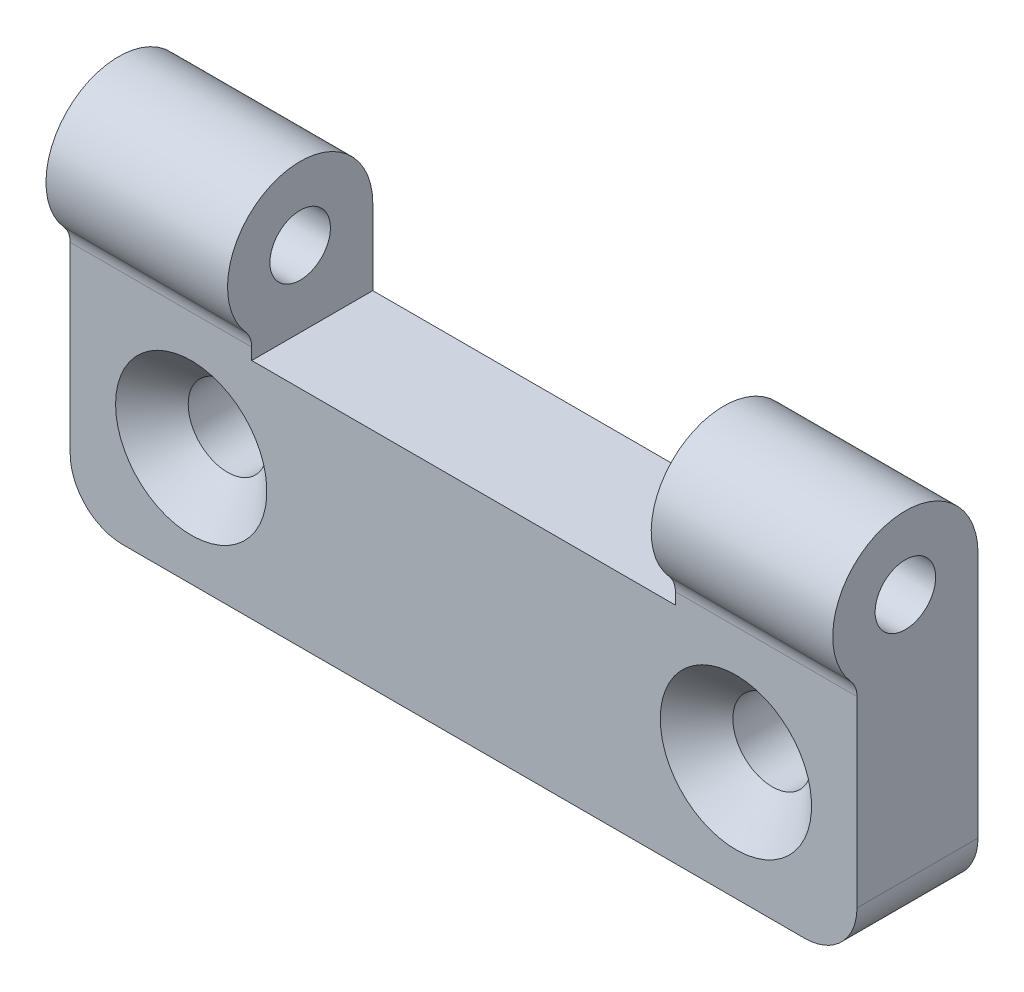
ISO-10303-21;
HEADER;
FILE_DESCRIPTION(('STEP AP214'),'2;1');
FILE_NAME('part.step','',(''),(''),'','','');
FILE_SCHEMA(('AUTOMOTIVE_DESIGN { 1 0 10303 214 1 1 1 1 }'));
ENDSEC;
DATA;
#1=APPLICATION_CONTEXT('core data for automotive mechanical design processes');
#2=APPLICATION_PROTOCOL_DEFINITION('international standard','automotive_design',2000,#1);
#3=PRODUCT_CONTEXT('',#1,'mechanical');
#4=PRODUCT('Part','Part','',(#3));
#5=PRODUCT_RELATED_PRODUCT_CATEGORY('part','',(#4));
#6=PRODUCT_DEFINITION_FORMATION('','',#4);
#7=PRODUCT_DEFINITION_CONTEXT('part definition',#1,'design');
#8=PRODUCT_DEFINITION('design','',#6,#7);
#9=PRODUCT_DEFINITION_SHAPE('','',#8);
#10=(LENGTH_UNIT() NAMED_UNIT(*) SI_UNIT(.MILLI.,.METRE.));
#11=(NAMED_UNIT(*) PLANE_ANGLE_UNIT() SI_UNIT($,.RADIAN.));
#12=(NAMED_UNIT(*) SI_UNIT($,.STERADIAN.) SOLID_ANGLE_UNIT());
#13=UNCERTAINTY_MEASURE_WITH_UNIT(LENGTH_MEASURE(1.E-05),#10,'distance_accuracy_value','');
#14=(GEOMETRIC_REPRESENTATION_CONTEXT(3) GLOBAL_UNCERTAINTY_ASSIGNED_CONTEXT((#13)) GLOBAL_UNIT_ASSIGNED_CONTEXT((#10,
#11,#12)) REPRESENTATION_CONTEXT('',''));
#15=CARTESIAN_POINT('',(0.,0.,0.));
#16=DIRECTION('',(0.,0.,1.));
#17=DIRECTION('',(1.,0.,0.));
#18=AXIS2_PLACEMENT_3D('',#15,#16,#17);
#19=CARTESIAN_POINT('',(-10.,9.70849737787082,12.));
#20=DIRECTION('',(-1.,0.,0.));
#21=DIRECTION('',(0.,-1.,0.));
#22=AXIS2_PLACEMENT_3D('',#19,#20,#21);
#23=CYLINDRICAL_SURFACE('',#22,2.);
#24=DIRECTION('',(-1.,0.,0.));
#25=VECTOR('',#24,1.);
#26=CARTESIAN_POINT('',(-10.,11.0313730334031,10.5));
#27=LINE('',#26,#25);
#28=CARTESIAN_POINT('',(-10.,11.0313730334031,10.5));
#29=VERTEX_POINT('',#28);
#30=CARTESIAN_POINT('',(5.,11.0313730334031,10.5));
#31=VERTEX_POINT('',#30);
#32=EDGE_CURVE('E91',#29,#31,#27,.F.);
#33=ORIENTED_EDGE('',*,*,#32,.F.);
#34=CARTESIAN_POINT('',(-10.,9.70849737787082,12.));
#35=DIRECTION('',(-1.,0.,0.));
#36=DIRECTION('',(0.,-1.,0.));
#37=AXIS2_PLACEMENT_3D('',#34,#35,#36);
#38=CIRCLE('',#37,2.);
#39=CARTESIAN_POINT('',(-10.,9.70849737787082,10.));
#40=VERTEX_POINT('',#39);
#41=EDGE_CURVE('E17',#40,#29,#38,.F.);
#42=ORIENTED_EDGE('',*,*,#41,.F.);
#43=DIRECTION('',(-1.,0.,0.));
#44=VECTOR('',#43,1.);
#45=CARTESIAN_POINT('',(22.5,9.70849737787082,10.));
#46=LINE('',#45,#44);
#47=CARTESIAN_POINT('',(5.,9.70849737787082,10.));
#48=VERTEX_POINT('',#47);
#49=EDGE_CURVE('E119',#48,#40,#46,.T.);
#50=ORIENTED_EDGE('',*,*,#49,.F.);
#51=CARTESIAN_POINT('',(5.,9.70849737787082,12.));
#52=DIRECTION('',(-1.,0.,0.));
#53=DIRECTION('',(0.,-1.,0.));
#54=AXIS2_PLACEMENT_3D('',#51,#52,#53);
#55=CIRCLE('',#54,2.);
#56=EDGE_CURVE('E105',#31,#48,#55,.T.);
#57=ORIENTED_EDGE('',*,*,#56,.F.);
#58=EDGE_LOOP('',(#33,#42,#50,#57));
#59=FACE_BOUND('',#58,.T.);
#60=ADVANCED_FACE('F14',(#59),#23,.F.);
#61=CARTESIAN_POINT('',(-10.,9.70849737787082,12.));
#62=DIRECTION('',(-1.,0.,0.));
#63=DIRECTION('',(0.,-1.,0.));
#64=AXIS2_PLACEMENT_3D('',#61,#62,#63);
#65=CYLINDRICAL_SURFACE('',#64,2.);
#66=DIRECTION('',(-1.,0.,0.));
#67=VECTOR('',#66,1.);
#68=CARTESIAN_POINT('',(22.5,9.70849737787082,10.));
#69=LINE('',#68,#67);
#70=CARTESIAN_POINT('',(55.,9.70849737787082,10.));
#71=VERTEX_POINT('',#70);
#72=CARTESIAN_POINT('',(40.,9.70849737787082,10.));
#73=VERTEX_POINT('',#72);
#74=EDGE_CURVE('E121',#71,#73,#69,.T.);
#75=ORIENTED_EDGE('',*,*,#74,.F.);
#76=CARTESIAN_POINT('',(55.,9.70849737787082,12.));
#77=DIRECTION('',(-1.,0.,0.));
#78=DIRECTION('',(0.,-1.,0.));
#79=AXIS2_PLACEMENT_3D('',#76,#77,#78);
#80=CIRCLE('',#79,2.);
#81=CARTESIAN_POINT('',(55.,11.0313730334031,10.5));
#82=VERTEX_POINT('',#81);
#83=EDGE_CURVE('E113',#82,#71,#80,.T.);
#84=ORIENTED_EDGE('',*,*,#83,.F.);
#85=DIRECTION('',(-1.,0.,0.));
#86=VECTOR('',#85,1.);
#87=CARTESIAN_POINT('',(-10.,11.0313730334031,10.5));
#88=LINE('',#87,#86);
#89=CARTESIAN_POINT('',(40.,11.0313730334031,10.5));
#90=VERTEX_POINT('',#89);
#91=EDGE_CURVE('E134',#90,#82,#88,.F.);
#92=ORIENTED_EDGE('',*,*,#91,.F.);
#93=CARTESIAN_POINT('',(40.,9.70849737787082,12.));
#94=DIRECTION('',(-1.,0.,0.));
#95=DIRECTION('',(0.,-1.,0.));
#96=AXIS2_PLACEMENT_3D('',#93,#94,#95);
#97=CIRCLE('',#96,2.);
#98=EDGE_CURVE('E108',#73,#90,#97,.F.);
#99=ORIENTED_EDGE('',*,*,#98,.F.);
#100=EDGE_LOOP('',(#75,#84,#92,#99));
#101=FACE_BOUND('',#100,.T.);
#102=ADVANCED_FACE('F310',(#101),#65,.F.);
#103=CARTESIAN_POINT('',(45.,0.,10.0000000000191));
#104=DIRECTION('',(0.,0.,1.));
#105=DIRECTION('',(-1.,0.,0.));
#106=AXIS2_PLACEMENT_3D('',#103,#104,#105);
#107=CONICAL_SURFACE('',#106,6.2500000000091,0.785398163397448);
#108=CARTESIAN_POINT('',(45.,0.,10.0000000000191));
#109=DIRECTION('',(0.,0.,1.));
#110=DIRECTION('',(-1.,0.,0.));
#111=AXIS2_PLACEMENT_3D('',#108,#109,#110);
#112=CIRCLE('',#111,6.2500000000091);
#113=CARTESIAN_POINT('',(38.7499999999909,0.,10.0000000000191));
#114=VERTEX_POINT('',#113);
#115=EDGE_CURVE('E107',#114,#114,#112,.F.);
#116=ORIENTED_EDGE('',*,*,#115,.F.);
#117=EDGE_LOOP('',(#116));
#118=FACE_BOUND('',#117,.T.);
#119=CARTESIAN_POINT('',(45.,0.,7.));
#120=DIRECTION('',(0.,0.,-1.));
#121=DIRECTION('',(1.,0.,0.));
#122=AXIS2_PLACEMENT_3D('',#119,#120,#121);
#123=CIRCLE('',#122,3.25);
#124=CARTESIAN_POINT('',(48.25,0.,7.));
#125=VERTEX_POINT('',#124);
#126=EDGE_CURVE('E131',#125,#125,#123,.T.);
#127=ORIENTED_EDGE('',*,*,#126,.T.);
#128=EDGE_LOOP('',(#127));
#129=FACE_BOUND('',#128,.T.);
#130=ADVANCED_FACE('F312',(#118,#129),#107,.F.);
#131=CARTESIAN_POINT('',(0.,0.,10.0000000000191));
#132=DIRECTION('',(0.,0.,1.));
#133=DIRECTION('',(-1.,0.,0.));
#134=AXIS2_PLACEMENT_3D('',#131,#132,#133);
#135=CONICAL_SURFACE('',#134,6.2500000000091,0.785398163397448);
#136=CARTESIAN_POINT('',(0.,0.,10.0000000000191));
#137=DIRECTION('',(0.,0.,1.));
#138=DIRECTION('',(-1.,0.,0.));
#139=AXIS2_PLACEMENT_3D('',#136,#137,#138);
#140=CIRCLE('',#139,6.2500000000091);
#141=CARTESIAN_POINT('',(-6.2500000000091,0.,10.0000000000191));
#142=VERTEX_POINT('',#141);
#143=EDGE_CURVE('E111',#142,#142,#140,.F.);
#144=ORIENTED_EDGE('',*,*,#143,.F.);
#145=EDGE_LOOP('',(#144));
#146=FACE_BOUND('',#145,.T.);
#147=CARTESIAN_POINT('',(0.,0.,7.));
#148=DIRECTION('',(0.,0.,-1.));
#149=DIRECTION('',(1.,0.,0.));
#150=AXIS2_PLACEMENT_3D('',#147,#148,#149);
#151=CIRCLE('',#150,3.25);
#152=CARTESIAN_POINT('',(3.25,0.,7.));
#153=VERTEX_POINT('',#152);
#154=EDGE_CURVE('E127',#153,#153,#151,.T.);
#155=ORIENTED_EDGE('',*,*,#154,.T.);
#156=EDGE_LOOP('',(#155));
#157=FACE_BOUND('',#156,.T.);
#158=ADVANCED_FACE('F318',(#146,#157),#135,.F.);
#159=CARTESIAN_POINT('',(-10.,15.,6.));
#160=DIRECTION('',(-1.,0.,0.));
#161=DIRECTION('',(0.,-1.,0.));
#162=AXIS2_PLACEMENT_3D('',#159,#160,#161);
#163=CYLINDRICAL_SURFACE('',#162,2.5);
#164=CARTESIAN_POINT('',(5.,15.,6.));
#165=DIRECTION('',(-1.,0.,0.));
#166=DIRECTION('',(0.,-1.,0.));
#167=AXIS2_PLACEMENT_3D('',#164,#165,#166);
#168=CIRCLE('',#167,2.5);
#169=CARTESIAN_POINT('',(5.,12.5,6.));
#170=VERTEX_POINT('',#169);
#171=EDGE_CURVE('E175',#170,#170,#168,.F.);
#172=ORIENTED_EDGE('',*,*,#171,.T.);
#173=EDGE_LOOP('',(#172));
#174=FACE_BOUND('',#173,.T.);
#175=CARTESIAN_POINT('',(-10.,15.,6.));
#176=DIRECTION('',(-1.,0.,0.));
#177=DIRECTION('',(0.,-1.,0.));
#178=AXIS2_PLACEMENT_3D('',#175,#176,#177);
#179=CIRCLE('',#178,2.5);
#180=CARTESIAN_POINT('',(-10.,12.5,6.));
#181=VERTEX_POINT('',#180);
#182=EDGE_CURVE('E169',#181,#181,#179,.F.);
#183=ORIENTED_EDGE('',*,*,#182,.F.);
#184=EDGE_LOOP('',(#183));
#185=FACE_BOUND('',#184,.T.);
#186=ADVANCED_FACE('F324',(#174,#185),#163,.F.);
#187=CARTESIAN_POINT('',(22.5,15.,10.));
#188=DIRECTION('',(0.,0.,1.));
#189=DIRECTION('',(-1.,0.,0.));
#190=AXIS2_PLACEMENT_3D('',#187,#188,#189);
#191=PLANE('',#190);
#192=DIRECTION('',(0.,1.,0.));
#193=VECTOR('',#192,1.);
#194=CARTESIAN_POINT('',(55.,6.58333333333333,10.));
#195=LINE('',#194,#193);
#196=CARTESIAN_POINT('',(55.,-5.4166666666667,10.));
#197=VERTEX_POINT('',#196);
#198=EDGE_CURVE('E162',#71,#197,#195,.F.);
#199=ORIENTED_EDGE('',*,*,#198,.F.);
#200=ORIENTED_EDGE('',*,*,#74,.T.);
#201=DIRECTION('',(0.,-1.,0.));
#202=VECTOR('',#201,1.);
#203=CARTESIAN_POINT('',(40.,15.,10.));
#204=LINE('',#203,#202);
#205=CARTESIAN_POINT('',(40.,8.75,10.));
#206=VERTEX_POINT('',#205);
#207=EDGE_CURVE('E122',#73,#206,#204,.T.);
#208=ORIENTED_EDGE('',*,*,#207,.T.);
#209=DIRECTION('',(1.,0.,0.));
#210=VECTOR('',#209,1.);
#211=CARTESIAN_POINT('',(40.,8.75,10.));
#212=LINE('',#211,#210);
#213=CARTESIAN_POINT('',(5.,8.75,10.));
#214=VERTEX_POINT('',#213);
#215=EDGE_CURVE('E130',#206,#214,#212,.F.);
#216=ORIENTED_EDGE('',*,*,#215,.T.);
#217=DIRECTION('',(0.,-1.,0.));
#218=VECTOR('',#217,1.);
#219=CARTESIAN_POINT('',(5.,8.75,10.));
#220=LINE('',#219,#218);
#221=EDGE_CURVE('E174',#214,#48,#220,.F.);
#222=ORIENTED_EDGE('',*,*,#221,.T.);
#223=ORIENTED_EDGE('',*,*,#49,.T.);
#224=DIRECTION('',(0.,-1.,0.));
#225=VECTOR('',#224,1.);
#226=CARTESIAN_POINT('',(-10.,-5.4166666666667,10.));
#227=LINE('',#226,#225);
#228=CARTESIAN_POINT('',(-10.,-5.4166666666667,10.));
#229=VERTEX_POINT('',#228);
#230=EDGE_CURVE('E98',#229,#40,#227,.F.);
#231=ORIENTED_EDGE('',*,*,#230,.F.);
#232=CARTESIAN_POINT('',(-5.6666666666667,-5.4166666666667,10.));
#233=DIRECTION('',(0.,0.,-1.));
#234=DIRECTION('',(1.,0.,0.));
#235=AXIS2_PLACEMENT_3D('',#232,#233,#234);
#236=CIRCLE('',#235,4.33333333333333);
#237=CARTESIAN_POINT('',(-5.6666666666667,-9.75,10.));
#238=VERTEX_POINT('',#237);
#239=EDGE_CURVE('E97',#238,#229,#236,.T.);
#240=ORIENTED_EDGE('',*,*,#239,.F.);
#241=DIRECTION('',(1.,0.,0.));
#242=VECTOR('',#241,1.);
#243=CARTESIAN_POINT('',(50.6666666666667,-9.75,10.));
#244=LINE('',#243,#242);
#245=CARTESIAN_POINT('',(50.6666666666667,-9.75,10.));
#246=VERTEX_POINT('',#245);
#247=EDGE_CURVE('E117',#246,#238,#244,.F.);
#248=ORIENTED_EDGE('',*,*,#247,.F.);
#249=CARTESIAN_POINT('',(50.6666666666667,-5.4166666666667,10.));
#250=DIRECTION('',(0.,0.,-1.));
#251=DIRECTION('',(1.,0.,0.));
#252=AXIS2_PLACEMENT_3D('',#249,#250,#251);
#253=CIRCLE('',#252,4.33333333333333);
#254=EDGE_CURVE('E164',#197,#246,#253,.T.);
#255=ORIENTED_EDGE('',*,*,#254,.F.);
#256=EDGE_LOOP('',(#199,#200,#208,#216,#222,#223,#231,#240,#248,#255));
#257=FACE_BOUND('',#256,.T.);
#258=ORIENTED_EDGE('',*,*,#143,.T.);
#259=EDGE_LOOP('',(#258));
#260=FACE_BOUND('',#259,.T.);
#261=ORIENTED_EDGE('',*,*,#115,.T.);
#262=EDGE_LOOP('',(#261));
#263=FACE_BOUND('',#262,.T.);
#264=ADVANCED_FACE('F192',(#257,#260,#263),#191,.T.);
#265=CARTESIAN_POINT('',(-10.,15.,6.));
#266=DIRECTION('',(-1.,0.,0.));
#267=DIRECTION('',(0.,-1.,0.));
#268=AXIS2_PLACEMENT_3D('',#265,#266,#267);
#269=CYLINDRICAL_SURFACE('',#268,2.5);
#270=CARTESIAN_POINT('',(55.,15.,6.));
#271=DIRECTION('',(-1.,0.,0.));
#272=DIRECTION('',(0.,-1.,0.));
#273=AXIS2_PLACEMENT_3D('',#270,#271,#272);
#274=CIRCLE('',#273,2.5);
#275=CARTESIAN_POINT('',(55.,12.5,6.));
#276=VERTEX_POINT('',#275);
#277=EDGE_CURVE('E159',#276,#276,#274,.T.);
#278=ORIENTED_EDGE('',*,*,#277,.F.);
#279=EDGE_LOOP('',(#278));
#280=FACE_BOUND('',#279,.T.);
#281=CARTESIAN_POINT('',(40.,15.,6.));
#282=DIRECTION('',(-1.,0.,0.));
#283=DIRECTION('',(0.,-1.,0.));
#284=AXIS2_PLACEMENT_3D('',#281,#282,#283);
#285=CIRCLE('',#284,2.5);
#286=CARTESIAN_POINT('',(40.,12.5,6.));
#287=VERTEX_POINT('',#286);
#288=EDGE_CURVE('E153',#287,#287,#285,.T.);
#289=ORIENTED_EDGE('',*,*,#288,.T.);
#290=EDGE_LOOP('',(#289));
#291=FACE_BOUND('',#290,.T.);
#292=ADVANCED_FACE('F331',(#280,#291),#269,.F.);
#293=CARTESIAN_POINT('',(45.,0.,3.5));
#294=DIRECTION('',(0.,0.,-1.));
#295=DIRECTION('',(1.,0.,0.));
#296=AXIS2_PLACEMENT_3D('',#293,#294,#295);
#297=CYLINDRICAL_SURFACE('',#296,3.25);
#298=ORIENTED_EDGE('',*,*,#126,.F.);
#299=EDGE_LOOP('',(#298));
#300=FACE_BOUND('',#299,.T.);
#301=CARTESIAN_POINT('',(45.,0.,0.));
#302=DIRECTION('',(0.,0.,-1.));
#303=DIRECTION('',(1.,0.,0.));
#304=AXIS2_PLACEMENT_3D('',#301,#302,#303);
#305=CIRCLE('',#304,3.25);
#306=CARTESIAN_POINT('',(48.25,0.,0.));
#307=VERTEX_POINT('',#306);
#308=EDGE_CURVE('E148',#307,#307,#305,.T.);
#309=ORIENTED_EDGE('',*,*,#308,.T.);
#310=EDGE_LOOP('',(#309));
#311=FACE_BOUND('',#310,.T.);
#312=ADVANCED_FACE('F334',(#300,#311),#297,.F.);
#313=CARTESIAN_POINT('',(0.,0.,3.5));
#314=DIRECTION('',(0.,0.,-1.));
#315=DIRECTION('',(1.,0.,0.));
#316=AXIS2_PLACEMENT_3D('',#313,#314,#315);
#317=CYLINDRICAL_SURFACE('',#316,3.25);
#318=ORIENTED_EDGE('',*,*,#154,.F.);
#319=EDGE_LOOP('',(#318));
#320=FACE_BOUND('',#319,.T.);
#321=CARTESIAN_POINT('',(0.,0.,0.));
#322=DIRECTION('',(0.,0.,-1.));
#323=DIRECTION('',(1.,0.,0.));
#324=AXIS2_PLACEMENT_3D('',#321,#322,#323);
#325=CIRCLE('',#324,3.25);
#326=CARTESIAN_POINT('',(3.25,0.,0.));
#327=VERTEX_POINT('',#326);
#328=EDGE_CURVE('E144',#327,#327,#325,.T.);
#329=ORIENTED_EDGE('',*,*,#328,.T.);
#330=EDGE_LOOP('',(#329));
#331=FACE_BOUND('',#330,.T.);
#332=ADVANCED_FACE('F338',(#320,#331),#317,.F.);
#333=CARTESIAN_POINT('',(40.,8.75,0.));
#334=DIRECTION('',(0.,-1.,0.));
#335=DIRECTION('',(1.,0.,0.));
#336=AXIS2_PLACEMENT_3D('',#333,#334,#335);
#337=PLANE('',#336);
#338=DIRECTION('',(0.,0.,1.));
#339=VECTOR('',#338,1.);
#340=CARTESIAN_POINT('',(40.,8.75,0.));
#341=LINE('',#340,#339);
#342=CARTESIAN_POINT('',(40.,8.75,0.));
#343=VERTEX_POINT('',#342);
#344=EDGE_CURVE('E152',#206,#343,#341,.F.);
#345=ORIENTED_EDGE('',*,*,#344,.T.);
#346=DIRECTION('',(-1.,0.,0.));
#347=VECTOR('',#346,1.);
#348=CARTESIAN_POINT('',(22.5,8.75,0.));
#349=LINE('',#348,#347);
#350=CARTESIAN_POINT('',(5.,8.75,0.));
#351=VERTEX_POINT('',#350);
#352=EDGE_CURVE('E147',#343,#351,#349,.T.);
#353=ORIENTED_EDGE('',*,*,#352,.T.);
#354=DIRECTION('',(0.,0.,1.));
#355=VECTOR('',#354,1.);
#356=CARTESIAN_POINT('',(5.,8.75,0.));
#357=LINE('',#356,#355);
#358=EDGE_CURVE('E178',#351,#214,#357,.T.);
#359=ORIENTED_EDGE('',*,*,#358,.T.);
#360=ORIENTED_EDGE('',*,*,#215,.F.);
#361=EDGE_LOOP('',(#345,#353,#359,#360));
#362=FACE_BOUND('',#361,.T.);
#363=ADVANCED_FACE('F251',(#362),#337,.F.);
#364=CARTESIAN_POINT('',(5.,8.75,0.));
#365=DIRECTION('',(-1.,0.,0.));
#366=DIRECTION('',(0.,-1.,0.));
#367=AXIS2_PLACEMENT_3D('',#364,#365,#366);
#368=PLANE('',#367);
#369=ORIENTED_EDGE('',*,*,#56,.T.);
#370=ORIENTED_EDGE('',*,*,#221,.F.);
#371=ORIENTED_EDGE('',*,*,#358,.F.);
#372=DIRECTION('',(0.,-1.,0.));
#373=VECTOR('',#372,1.);
#374=CARTESIAN_POINT('',(5.,15.,0.));
#375=LINE('',#374,#373);
#376=CARTESIAN_POINT('',(5.,15.,0.));
#377=VERTEX_POINT('',#376);
#378=EDGE_CURVE('E231',#351,#377,#375,.F.);
#379=ORIENTED_EDGE('',*,*,#378,.T.);
#380=CARTESIAN_POINT('',(5.,15.,6.));
#381=DIRECTION('',(-1.,0.,0.));
#382=DIRECTION('',(0.,-1.,0.));
#383=AXIS2_PLACEMENT_3D('',#380,#381,#382);
#384=CIRCLE('',#383,6.);
#385=EDGE_CURVE('E172',#31,#377,#384,.T.);
#386=ORIENTED_EDGE('',*,*,#385,.F.);
#387=EDGE_LOOP('',(#369,#370,#371,#379,#386));
#388=FACE_BOUND('',#387,.T.);
#389=ORIENTED_EDGE('',*,*,#171,.F.);
#390=EDGE_LOOP('',(#389));
#391=FACE_BOUND('',#390,.T.);
#392=ADVANCED_FACE('F183',(#388,#391),#368,.F.);
#393=CARTESIAN_POINT('',(-10.,15.,6.));
#394=DIRECTION('',(-1.,0.,0.));
#395=DIRECTION('',(0.,-1.,0.));
#396=AXIS2_PLACEMENT_3D('',#393,#394,#395);
#397=CYLINDRICAL_SURFACE('',#396,6.);
#398=DIRECTION('',(-1.,0.,0.));
#399=VECTOR('',#398,1.);
#400=CARTESIAN_POINT('',(22.5,15.,0.));
#401=LINE('',#400,#399);
#402=CARTESIAN_POINT('',(-10.,15.,0.));
#403=VERTEX_POINT('',#402);
#404=EDGE_CURVE('E93',#377,#403,#401,.T.);
#405=ORIENTED_EDGE('',*,*,#404,.T.);
#406=CARTESIAN_POINT('',(-10.,15.,6.));
#407=DIRECTION('',(-1.,0.,0.));
#408=DIRECTION('',(0.,-1.,0.));
#409=AXIS2_PLACEMENT_3D('',#406,#407,#408);
#410=CIRCLE('',#409,6.);
#411=EDGE_CURVE('E89',#29,#403,#410,.T.);
#412=ORIENTED_EDGE('',*,*,#411,.F.);
#413=ORIENTED_EDGE('',*,*,#32,.T.);
#414=ORIENTED_EDGE('',*,*,#385,.T.);
#415=EDGE_LOOP('',(#405,#412,#413,#414));
#416=FACE_BOUND('',#415,.T.);
#417=ADVANCED_FACE('F90',(#416),#397,.T.);
#418=CARTESIAN_POINT('',(-10.,-5.4166666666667,0.));
#419=DIRECTION('',(-1.,0.,0.));
#420=DIRECTION('',(0.,-1.,0.));
#421=AXIS2_PLACEMENT_3D('',#418,#419,#420);
#422=PLANE('',#421);
#423=ORIENTED_EDGE('',*,*,#41,.T.);
#424=ORIENTED_EDGE('',*,*,#411,.T.);
#425=DIRECTION('',(0.,-1.,0.));
#426=VECTOR('',#425,1.);
#427=CARTESIAN_POINT('',(-10.,15.,0.));
#428=LINE('',#427,#426);
#429=CARTESIAN_POINT('',(-10.,-5.4166666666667,0.));
#430=VERTEX_POINT('',#429);
#431=EDGE_CURVE('E143',#403,#430,#428,.T.);
#432=ORIENTED_EDGE('',*,*,#431,.T.);
#433=DIRECTION('',(0.,0.,-1.));
#434=VECTOR('',#433,1.);
#435=CARTESIAN_POINT('',(-10.,-5.4166666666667,0.));
#436=LINE('',#435,#434);
#437=EDGE_CURVE('E167',#229,#430,#436,.T.);
#438=ORIENTED_EDGE('',*,*,#437,.F.);
#439=ORIENTED_EDGE('',*,*,#230,.T.);
#440=EDGE_LOOP('',(#423,#424,#432,#438,#439));
#441=FACE_BOUND('',#440,.T.);
#442=ORIENTED_EDGE('',*,*,#182,.T.);
#443=EDGE_LOOP('',(#442));
#444=FACE_BOUND('',#443,.T.);
#445=ADVANCED_FACE('F101',(#441,#444),#422,.T.);
#446=CARTESIAN_POINT('',(-5.6666666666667,-5.4166666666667,0.));
#447=DIRECTION('',(0.,0.,-1.));
#448=DIRECTION('',(1.,0.,0.));
#449=AXIS2_PLACEMENT_3D('',#446,#447,#448);
#450=CYLINDRICAL_SURFACE('',#449,4.33333333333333);
#451=CARTESIAN_POINT('',(-5.6666666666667,-5.4166666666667,0.));
#452=DIRECTION('',(0.,0.,-1.));
#453=DIRECTION('',(1.,0.,0.));
#454=AXIS2_PLACEMENT_3D('',#451,#452,#453);
#455=CIRCLE('',#454,4.33333333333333);
#456=CARTESIAN_POINT('',(-5.6666666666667,-9.75,0.));
#457=VERTEX_POINT('',#456);
#458=EDGE_CURVE('E140',#430,#457,#455,.F.);
#459=ORIENTED_EDGE('',*,*,#458,.T.);
#460=DIRECTION('',(0.,0.,1.));
#461=VECTOR('',#460,1.);
#462=CARTESIAN_POINT('',(-5.6666666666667,-9.75,0.));
#463=LINE('',#462,#461);
#464=EDGE_CURVE('E166',#238,#457,#463,.F.);
#465=ORIENTED_EDGE('',*,*,#464,.F.);
#466=ORIENTED_EDGE('',*,*,#239,.T.);
#467=ORIENTED_EDGE('',*,*,#437,.T.);
#468=EDGE_LOOP('',(#459,#465,#466,#467));
#469=FACE_BOUND('',#468,.T.);
#470=ADVANCED_FACE('F270',(#469),#450,.T.);
#471=CARTESIAN_POINT('',(50.6666666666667,-9.75,0.));
#472=DIRECTION('',(0.,-1.,0.));
#473=DIRECTION('',(1.,0.,0.));
#474=AXIS2_PLACEMENT_3D('',#471,#472,#473);
#475=PLANE('',#474);
#476=DIRECTION('',(-1.,0.,0.));
#477=VECTOR('',#476,1.);
#478=CARTESIAN_POINT('',(22.5,-9.75,0.));
#479=LINE('',#478,#477);
#480=CARTESIAN_POINT('',(50.6666666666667,-9.75,0.));
#481=VERTEX_POINT('',#480);
#482=EDGE_CURVE('E139',#457,#481,#479,.F.);
#483=ORIENTED_EDGE('',*,*,#482,.T.);
#484=DIRECTION('',(0.,0.,-1.));
#485=VECTOR('',#484,1.);
#486=CARTESIAN_POINT('',(50.6666666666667,-9.75,0.));
#487=LINE('',#486,#485);
#488=EDGE_CURVE('E163',#246,#481,#487,.T.);
#489=ORIENTED_EDGE('',*,*,#488,.F.);
#490=ORIENTED_EDGE('',*,*,#247,.T.);
#491=ORIENTED_EDGE('',*,*,#464,.T.);
#492=EDGE_LOOP('',(#483,#489,#490,#491));
#493=FACE_BOUND('',#492,.T.);
#494=ADVANCED_FACE('F263',(#493),#475,.T.);
#495=CARTESIAN_POINT('',(50.6666666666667,-5.4166666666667,0.));
#496=DIRECTION('',(0.,0.,-1.));
#497=DIRECTION('',(1.,0.,0.));
#498=AXIS2_PLACEMENT_3D('',#495,#496,#497);
#499=CYLINDRICAL_SURFACE('',#498,4.33333333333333);
#500=CARTESIAN_POINT('',(50.6666666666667,-5.4166666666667,0.));
#501=DIRECTION('',(0.,0.,-1.));
#502=DIRECTION('',(1.,0.,0.));
#503=AXIS2_PLACEMENT_3D('',#500,#501,#502);
#504=CIRCLE('',#503,4.33333333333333);
#505=CARTESIAN_POINT('',(55.,-5.4166666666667,0.));
#506=VERTEX_POINT('',#505);
#507=EDGE_CURVE('E135',#481,#506,#504,.F.);
#508=ORIENTED_EDGE('',*,*,#507,.T.);
#509=DIRECTION('',(0.,0.,1.));
#510=VECTOR('',#509,1.);
#511=CARTESIAN_POINT('',(55.,-5.4166666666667,0.));
#512=LINE('',#511,#510);
#513=EDGE_CURVE('E158',#197,#506,#512,.F.);
#514=ORIENTED_EDGE('',*,*,#513,.F.);
#515=ORIENTED_EDGE('',*,*,#254,.T.);
#516=ORIENTED_EDGE('',*,*,#488,.T.);
#517=EDGE_LOOP('',(#508,#514,#515,#516));
#518=FACE_BOUND('',#517,.T.);
#519=ADVANCED_FACE('F279',(#518),#499,.T.);
#520=CARTESIAN_POINT('',(55.,6.58333333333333,0.));
#521=DIRECTION('',(1.,0.,0.));
#522=DIRECTION('',(0.,1.,0.));
#523=AXIS2_PLACEMENT_3D('',#520,#521,#522);
#524=PLANE('',#523);
#525=CARTESIAN_POINT('',(55.,15.,6.));
#526=DIRECTION('',(-1.,0.,0.));
#527=DIRECTION('',(0.,-1.,0.));
#528=AXIS2_PLACEMENT_3D('',#525,#526,#527);
#529=CIRCLE('',#528,6.);
#530=CARTESIAN_POINT('',(55.,15.,0.));
#531=VERTEX_POINT('',#530);
#532=EDGE_CURVE('E156',#82,#531,#529,.T.);
#533=ORIENTED_EDGE('',*,*,#532,.F.);
#534=ORIENTED_EDGE('',*,*,#83,.T.);
#535=ORIENTED_EDGE('',*,*,#198,.T.);
#536=ORIENTED_EDGE('',*,*,#513,.T.);
#537=DIRECTION('',(0.,-1.,0.));
#538=VECTOR('',#537,1.);
#539=CARTESIAN_POINT('',(55.,15.,0.));
#540=LINE('',#539,#538);
#541=EDGE_CURVE('E138',#506,#531,#540,.F.);
#542=ORIENTED_EDGE('',*,*,#541,.T.);
#543=EDGE_LOOP('',(#533,#534,#535,#536,#542));
#544=FACE_BOUND('',#543,.T.);
#545=ORIENTED_EDGE('',*,*,#277,.T.);
#546=EDGE_LOOP('',(#545));
#547=FACE_BOUND('',#546,.T.);
#548=ADVANCED_FACE('F293',(#544,#547),#524,.T.);
#549=CARTESIAN_POINT('',(-10.,15.,6.));
#550=DIRECTION('',(-1.,0.,0.));
#551=DIRECTION('',(0.,-1.,0.));
#552=AXIS2_PLACEMENT_3D('',#549,#550,#551);
#553=CYLINDRICAL_SURFACE('',#552,6.);
#554=DIRECTION('',(-1.,0.,0.));
#555=VECTOR('',#554,1.);
#556=CARTESIAN_POINT('',(22.5,15.,0.));
#557=LINE('',#556,#555);
#558=CARTESIAN_POINT('',(40.,15.,0.));
#559=VERTEX_POINT('',#558);
#560=EDGE_CURVE('E23',#531,#559,#557,.T.);
#561=ORIENTED_EDGE('',*,*,#560,.T.);
#562=CARTESIAN_POINT('',(40.,15.,6.));
#563=DIRECTION('',(-1.,0.,0.));
#564=DIRECTION('',(0.,-1.,0.));
#565=AXIS2_PLACEMENT_3D('',#562,#563,#564);
#566=CIRCLE('',#565,6.);
#567=EDGE_CURVE('E31',#559,#90,#566,.F.);
#568=ORIENTED_EDGE('',*,*,#567,.T.);
#569=ORIENTED_EDGE('',*,*,#91,.T.);
#570=ORIENTED_EDGE('',*,*,#532,.T.);
#571=EDGE_LOOP('',(#561,#568,#569,#570));
#572=FACE_BOUND('',#571,.T.);
#573=ADVANCED_FACE('F288',(#572),#553,.T.);
#574=CARTESIAN_POINT('',(40.,28.75,0.));
#575=DIRECTION('',(1.,0.,0.));
#576=DIRECTION('',(0.,1.,0.));
#577=AXIS2_PLACEMENT_3D('',#574,#575,#576);
#578=PLANE('',#577);
#579=DIRECTION('',(0.,-1.,0.));
#580=VECTOR('',#579,1.);
#581=CARTESIAN_POINT('',(40.,15.,0.));
#582=LINE('',#581,#580);
#583=EDGE_CURVE('E9',#559,#343,#582,.T.);
#584=ORIENTED_EDGE('',*,*,#583,.T.);
#585=ORIENTED_EDGE('',*,*,#344,.F.);
#586=ORIENTED_EDGE('',*,*,#207,.F.);
#587=ORIENTED_EDGE('',*,*,#98,.T.);
#588=ORIENTED_EDGE('',*,*,#567,.F.);
#589=EDGE_LOOP('',(#584,#585,#586,#587,#588));
#590=FACE_BOUND('',#589,.T.);
#591=ORIENTED_EDGE('',*,*,#288,.F.);
#592=EDGE_LOOP('',(#591));
#593=FACE_BOUND('',#592,.T.);
#594=ADVANCED_FACE('F216',(#590,#593),#578,.F.);
#595=CARTESIAN_POINT('',(22.5,15.,0.));
#596=DIRECTION('',(0.,0.,1.));
#597=DIRECTION('',(-1.,0.,0.));
#598=AXIS2_PLACEMENT_3D('',#595,#596,#597);
#599=PLANE('',#598);
#600=ORIENTED_EDGE('',*,*,#560,.F.);
#601=ORIENTED_EDGE('',*,*,#541,.F.);
#602=ORIENTED_EDGE('',*,*,#507,.F.);
#603=ORIENTED_EDGE('',*,*,#482,.F.);
#604=ORIENTED_EDGE('',*,*,#458,.F.);
#605=ORIENTED_EDGE('',*,*,#431,.F.);
#606=ORIENTED_EDGE('',*,*,#404,.F.);
#607=ORIENTED_EDGE('',*,*,#378,.F.);
#608=ORIENTED_EDGE('',*,*,#352,.F.);
#609=ORIENTED_EDGE('',*,*,#583,.F.);
#610=EDGE_LOOP('',(#600,#601,#602,#603,#604,#605,#606,#607,#608,#609));
#611=FACE_BOUND('',#610,.T.);
#612=ORIENTED_EDGE('',*,*,#328,.F.);
#613=EDGE_LOOP('',(#612));
#614=FACE_BOUND('',#613,.T.);
#615=ORIENTED_EDGE('',*,*,#308,.F.);
#616=EDGE_LOOP('',(#615));
#617=FACE_BOUND('',#616,.T.);
#618=ADVANCED_FACE('F248',(#611,#614,#617),#599,.F.);
#619=CLOSED_SHELL('',(#60,#102,#130,#158,#186,#264,#292,#312,#332,#363,#392,#417,#445,#470,#494,
#519,#548,#573,#594,#618));
#620=MANIFOLD_SOLID_BREP('B1',#619);
#621=ADVANCED_BREP_SHAPE_REPRESENTATION('',(#18,#620),#14);
#622=SHAPE_DEFINITION_REPRESENTATION(#9,#621);
ENDSEC;
END-ISO-10303-21;
